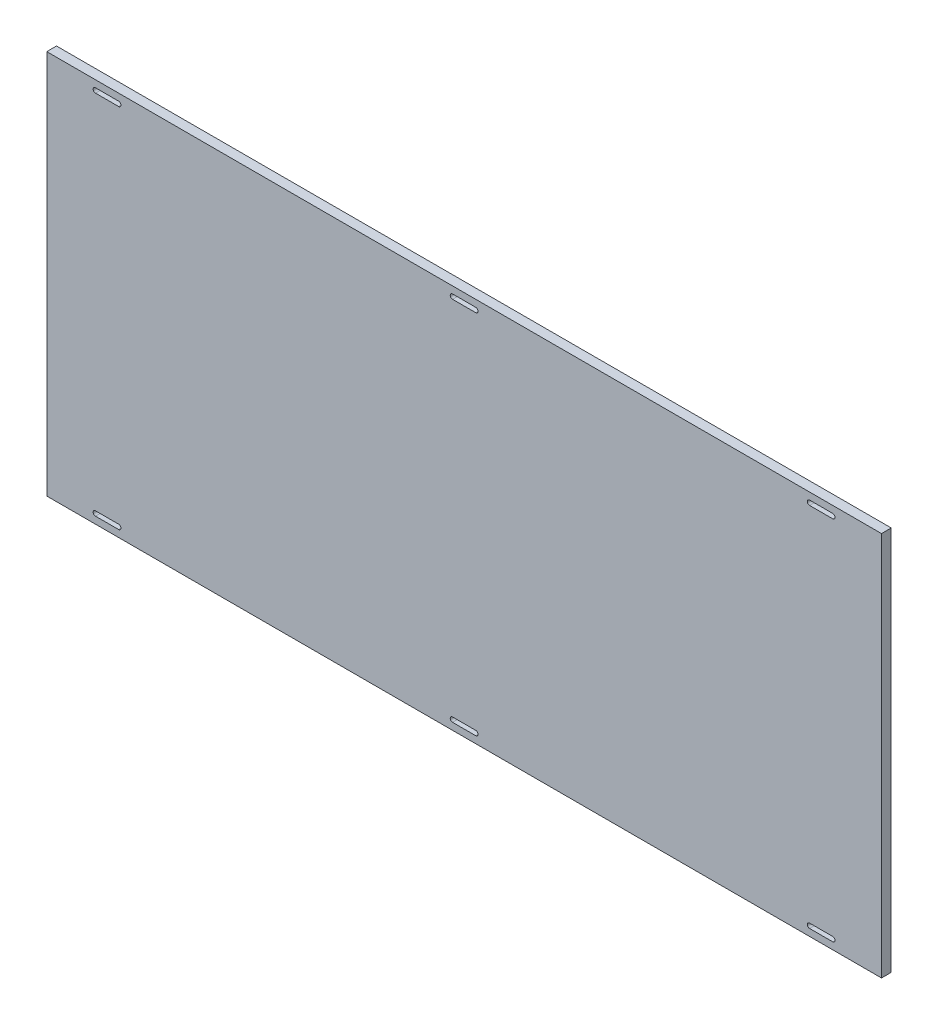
ISO-10303-21;
HEADER;
FILE_DESCRIPTION(('STEP AP214'),'2;1');
FILE_NAME('part.step','',(''),(''),'','','');
FILE_SCHEMA(('AUTOMOTIVE_DESIGN { 1 0 10303 214 1 1 1 1 }'));
ENDSEC;
DATA;
#1=APPLICATION_CONTEXT('core data for automotive mechanical design processes');
#2=APPLICATION_PROTOCOL_DEFINITION('international standard','automotive_design',2000,#1);
#3=PRODUCT_CONTEXT('',#1,'mechanical');
#4=PRODUCT('Part','Part','',(#3));
#5=PRODUCT_RELATED_PRODUCT_CATEGORY('part','',(#4));
#6=PRODUCT_DEFINITION_FORMATION('','',#4);
#7=PRODUCT_DEFINITION_CONTEXT('part definition',#1,'design');
#8=PRODUCT_DEFINITION('design','',#6,#7);
#9=PRODUCT_DEFINITION_SHAPE('','',#8);
#10=(LENGTH_UNIT() NAMED_UNIT(*) SI_UNIT(.MILLI.,.METRE.));
#11=(NAMED_UNIT(*) PLANE_ANGLE_UNIT() SI_UNIT($,.RADIAN.));
#12=(NAMED_UNIT(*) SI_UNIT($,.STERADIAN.) SOLID_ANGLE_UNIT());
#13=UNCERTAINTY_MEASURE_WITH_UNIT(LENGTH_MEASURE(1.E-05),#10,'distance_accuracy_value','');
#14=(GEOMETRIC_REPRESENTATION_CONTEXT(3) GLOBAL_UNCERTAINTY_ASSIGNED_CONTEXT((#13)) GLOBAL_UNIT_ASSIGNED_CONTEXT((#10,
#11,#12)) REPRESENTATION_CONTEXT('',''));
#15=CARTESIAN_POINT('',(0.,0.,0.));
#16=DIRECTION('',(0.,0.,1.));
#17=DIRECTION('',(1.,0.,0.));
#18=AXIS2_PLACEMENT_3D('',#15,#16,#17);
#19=CARTESIAN_POINT('',(-900.,-415.,0.));
#20=DIRECTION('',(0.,0.,1.));
#21=DIRECTION('',(1.,0.,0.));
#22=AXIS2_PLACEMENT_3D('',#19,#20,#21);
#23=PLANE('',#22);
#24=DIRECTION('',(1.,0.,0.));
#25=VECTOR('',#24,1.);
#26=CARTESIAN_POINT('',(-900.,415.,0.));
#27=LINE('',#26,#25);
#28=CARTESIAN_POINT('',(-900.,415.,0.));
#29=VERTEX_POINT('',#28);
#30=CARTESIAN_POINT('',(900.,415.,0.));
#31=VERTEX_POINT('',#30);
#32=EDGE_CURVE('E311',#29,#31,#27,.T.);
#33=ORIENTED_EDGE('',*,*,#32,.T.);
#34=DIRECTION('',(0.,1.,0.));
#35=VECTOR('',#34,1.);
#36=CARTESIAN_POINT('',(900.,415.,0.));
#37=LINE('',#36,#35);
#38=CARTESIAN_POINT('',(900.,-415.,0.));
#39=VERTEX_POINT('',#38);
#40=EDGE_CURVE('E374',#31,#39,#37,.F.);
#41=ORIENTED_EDGE('',*,*,#40,.T.);
#42=DIRECTION('',(1.,0.,0.));
#43=VECTOR('',#42,1.);
#44=CARTESIAN_POINT('',(-900.,-415.,0.));
#45=LINE('',#44,#43);
#46=CARTESIAN_POINT('',(-900.,-415.,0.));
#47=VERTEX_POINT('',#46);
#48=EDGE_CURVE('E369',#39,#47,#45,.F.);
#49=ORIENTED_EDGE('',*,*,#48,.T.);
#50=DIRECTION('',(0.,1.,0.));
#51=VECTOR('',#50,1.);
#52=CARTESIAN_POINT('',(-900.,415.,0.));
#53=LINE('',#52,#51);
#54=EDGE_CURVE('E365',#47,#29,#53,.T.);
#55=ORIENTED_EDGE('',*,*,#54,.T.);
#56=EDGE_LOOP('',(#33,#41,#49,#55));
#57=FACE_BOUND('',#56,.T.);
#58=CARTESIAN_POINT('',(-25.,-395.,0.));
#59=DIRECTION('',(0.,0.,1.));
#60=DIRECTION('',(1.,0.,0.));
#61=AXIS2_PLACEMENT_3D('',#58,#59,#60);
#62=CIRCLE('',#61,5.);
#63=CARTESIAN_POINT('',(-25.,-390.,0.));
#64=VERTEX_POINT('',#63);
#65=CARTESIAN_POINT('',(-25.,-400.,0.));
#66=VERTEX_POINT('',#65);
#67=EDGE_CURVE('E230',#64,#66,#62,.T.);
#68=ORIENTED_EDGE('',*,*,#67,.T.);
#69=DIRECTION('',(1.,0.,0.));
#70=VECTOR('',#69,1.);
#71=CARTESIAN_POINT('',(-25.,-400.,0.));
#72=LINE('',#71,#70);
#73=CARTESIAN_POINT('',(25.,-400.,0.));
#74=VERTEX_POINT('',#73);
#75=EDGE_CURVE('E223',#66,#74,#72,.T.);
#76=ORIENTED_EDGE('',*,*,#75,.T.);
#77=CARTESIAN_POINT('',(25.,-395.,0.));
#78=DIRECTION('',(0.,0.,1.));
#79=DIRECTION('',(1.,0.,0.));
#80=AXIS2_PLACEMENT_3D('',#77,#78,#79);
#81=CIRCLE('',#80,5.);
#82=CARTESIAN_POINT('',(25.,-390.,0.));
#83=VERTEX_POINT('',#82);
#84=EDGE_CURVE('E312',#74,#83,#81,.T.);
#85=ORIENTED_EDGE('',*,*,#84,.T.);
#86=DIRECTION('',(1.,0.,0.));
#87=VECTOR('',#86,1.);
#88=CARTESIAN_POINT('',(-25.,-390.,0.));
#89=LINE('',#88,#87);
#90=EDGE_CURVE('E227',#83,#64,#89,.F.);
#91=ORIENTED_EDGE('',*,*,#90,.T.);
#92=EDGE_LOOP('',(#68,#76,#85,#91));
#93=FACE_BOUND('',#92,.T.);
#94=CARTESIAN_POINT('',(-795.,-395.,0.));
#95=DIRECTION('',(0.,0.,1.));
#96=DIRECTION('',(1.,0.,0.));
#97=AXIS2_PLACEMENT_3D('',#94,#95,#96);
#98=CIRCLE('',#97,5.);
#99=CARTESIAN_POINT('',(-795.,-390.,0.));
#100=VERTEX_POINT('',#99);
#101=CARTESIAN_POINT('',(-795.,-400.,0.));
#102=VERTEX_POINT('',#101);
#103=EDGE_CURVE('E238',#100,#102,#98,.T.);
#104=ORIENTED_EDGE('',*,*,#103,.T.);
#105=DIRECTION('',(1.,0.,0.));
#106=VECTOR('',#105,1.);
#107=CARTESIAN_POINT('',(-795.,-400.,0.));
#108=LINE('',#107,#106);
#109=CARTESIAN_POINT('',(-745.,-400.,0.));
#110=VERTEX_POINT('',#109);
#111=EDGE_CURVE('E231',#102,#110,#108,.T.);
#112=ORIENTED_EDGE('',*,*,#111,.T.);
#113=CARTESIAN_POINT('',(-745.,-395.,0.));
#114=DIRECTION('',(0.,0.,1.));
#115=DIRECTION('',(1.,0.,0.));
#116=AXIS2_PLACEMENT_3D('',#113,#114,#115);
#117=CIRCLE('',#116,5.);
#118=CARTESIAN_POINT('',(-745.,-390.,0.));
#119=VERTEX_POINT('',#118);
#120=EDGE_CURVE('E316',#110,#119,#117,.T.);
#121=ORIENTED_EDGE('',*,*,#120,.T.);
#122=DIRECTION('',(1.,0.,0.));
#123=VECTOR('',#122,1.);
#124=CARTESIAN_POINT('',(-795.,-390.,0.));
#125=LINE('',#124,#123);
#126=EDGE_CURVE('E235',#119,#100,#125,.F.);
#127=ORIENTED_EDGE('',*,*,#126,.T.);
#128=EDGE_LOOP('',(#104,#112,#121,#127));
#129=FACE_BOUND('',#128,.T.);
#130=DIRECTION('',(1.,0.,0.));
#131=VECTOR('',#130,1.);
#132=CARTESIAN_POINT('',(795.,-400.,0.));
#133=LINE('',#132,#131);
#134=CARTESIAN_POINT('',(745.,-400.,0.));
#135=VERTEX_POINT('',#134);
#136=CARTESIAN_POINT('',(795.,-400.,0.));
#137=VERTEX_POINT('',#136);
#138=EDGE_CURVE('E243',#135,#137,#133,.T.);
#139=ORIENTED_EDGE('',*,*,#138,.T.);
#140=CARTESIAN_POINT('',(795.,-395.,0.));
#141=DIRECTION('',(0.,0.,1.));
#142=DIRECTION('',(1.,0.,0.));
#143=AXIS2_PLACEMENT_3D('',#140,#141,#142);
#144=CIRCLE('',#143,5.);
#145=CARTESIAN_POINT('',(795.,-390.,0.));
#146=VERTEX_POINT('',#145);
#147=EDGE_CURVE('E320',#137,#146,#144,.T.);
#148=ORIENTED_EDGE('',*,*,#147,.T.);
#149=DIRECTION('',(-1.,0.,0.));
#150=VECTOR('',#149,1.);
#151=CARTESIAN_POINT('',(795.,-390.,0.));
#152=LINE('',#151,#150);
#153=CARTESIAN_POINT('',(745.,-390.,0.));
#154=VERTEX_POINT('',#153);
#155=EDGE_CURVE('E239',#146,#154,#152,.T.);
#156=ORIENTED_EDGE('',*,*,#155,.T.);
#157=CARTESIAN_POINT('',(745.,-395.,0.));
#158=DIRECTION('',(0.,0.,1.));
#159=DIRECTION('',(1.,0.,0.));
#160=AXIS2_PLACEMENT_3D('',#157,#158,#159);
#161=CIRCLE('',#160,5.);
#162=EDGE_CURVE('E324',#154,#135,#161,.T.);
#163=ORIENTED_EDGE('',*,*,#162,.T.);
#164=EDGE_LOOP('',(#139,#148,#156,#163));
#165=FACE_BOUND('',#164,.T.);
#166=DIRECTION('',(1.,0.,0.));
#167=VECTOR('',#166,1.);
#168=CARTESIAN_POINT('',(795.,390.,0.));
#169=LINE('',#168,#167);
#170=CARTESIAN_POINT('',(745.,390.,0.));
#171=VERTEX_POINT('',#170);
#172=CARTESIAN_POINT('',(795.,390.,0.));
#173=VERTEX_POINT('',#172);
#174=EDGE_CURVE('E252',#171,#173,#169,.T.);
#175=ORIENTED_EDGE('',*,*,#174,.T.);
#176=CARTESIAN_POINT('',(795.,395.,0.));
#177=DIRECTION('',(0.,0.,1.));
#178=DIRECTION('',(1.,0.,0.));
#179=AXIS2_PLACEMENT_3D('',#176,#177,#178);
#180=CIRCLE('',#179,5.);
#181=CARTESIAN_POINT('',(795.,400.,0.));
#182=VERTEX_POINT('',#181);
#183=EDGE_CURVE('E247',#173,#182,#180,.T.);
#184=ORIENTED_EDGE('',*,*,#183,.T.);
#185=DIRECTION('',(-1.,0.,0.));
#186=VECTOR('',#185,1.);
#187=CARTESIAN_POINT('',(795.,400.,0.));
#188=LINE('',#187,#186);
#189=CARTESIAN_POINT('',(745.,400.,0.));
#190=VERTEX_POINT('',#189);
#191=EDGE_CURVE('E248',#182,#190,#188,.T.);
#192=ORIENTED_EDGE('',*,*,#191,.T.);
#193=CARTESIAN_POINT('',(745.,395.,0.));
#194=DIRECTION('',(0.,0.,1.));
#195=DIRECTION('',(1.,0.,0.));
#196=AXIS2_PLACEMENT_3D('',#193,#194,#195);
#197=CIRCLE('',#196,5.);
#198=EDGE_CURVE('E329',#190,#171,#197,.T.);
#199=ORIENTED_EDGE('',*,*,#198,.T.);
#200=EDGE_LOOP('',(#175,#184,#192,#199));
#201=FACE_BOUND('',#200,.T.);
#202=DIRECTION('',(1.,0.,0.));
#203=VECTOR('',#202,1.);
#204=CARTESIAN_POINT('',(-25.0000000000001,390.,0.));
#205=LINE('',#204,#203);
#206=CARTESIAN_POINT('',(-25.0000000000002,390.,0.));
#207=VERTEX_POINT('',#206);
#208=CARTESIAN_POINT('',(25.,390.,0.));
#209=VERTEX_POINT('',#208);
#210=EDGE_CURVE('E261',#207,#209,#205,.T.);
#211=ORIENTED_EDGE('',*,*,#210,.T.);
#212=CARTESIAN_POINT('',(25.,395.,0.));
#213=DIRECTION('',(0.,0.,1.));
#214=DIRECTION('',(1.,0.,0.));
#215=AXIS2_PLACEMENT_3D('',#212,#213,#214);
#216=CIRCLE('',#215,5.);
#217=CARTESIAN_POINT('',(25.,400.,0.));
#218=VERTEX_POINT('',#217);
#219=EDGE_CURVE('E256',#209,#218,#216,.T.);
#220=ORIENTED_EDGE('',*,*,#219,.T.);
#221=DIRECTION('',(1.,0.,0.));
#222=VECTOR('',#221,1.);
#223=CARTESIAN_POINT('',(-25.0000000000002,400.,0.));
#224=LINE('',#223,#222);
#225=CARTESIAN_POINT('',(-25.0000000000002,400.,0.));
#226=VERTEX_POINT('',#225);
#227=EDGE_CURVE('E257',#218,#226,#224,.F.);
#228=ORIENTED_EDGE('',*,*,#227,.T.);
#229=CARTESIAN_POINT('',(-25.0000000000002,395.,0.));
#230=DIRECTION('',(0.,0.,1.));
#231=DIRECTION('',(1.,0.,0.));
#232=AXIS2_PLACEMENT_3D('',#229,#230,#231);
#233=CIRCLE('',#232,5.);
#234=EDGE_CURVE('E334',#226,#207,#233,.T.);
#235=ORIENTED_EDGE('',*,*,#234,.T.);
#236=EDGE_LOOP('',(#211,#220,#228,#235));
#237=FACE_BOUND('',#236,.T.);
#238=CARTESIAN_POINT('',(-795.,395.,0.));
#239=DIRECTION('',(0.,0.,1.));
#240=DIRECTION('',(1.,0.,0.));
#241=AXIS2_PLACEMENT_3D('',#238,#239,#240);
#242=CIRCLE('',#241,5.);
#243=CARTESIAN_POINT('',(-795.,400.,0.));
#244=VERTEX_POINT('',#243);
#245=CARTESIAN_POINT('',(-795.,390.,0.));
#246=VERTEX_POINT('',#245);
#247=EDGE_CURVE('E19',#244,#246,#242,.T.);
#248=ORIENTED_EDGE('',*,*,#247,.T.);
#249=DIRECTION('',(1.,0.,0.));
#250=VECTOR('',#249,1.);
#251=CARTESIAN_POINT('',(-795.,390.,0.));
#252=LINE('',#251,#250);
#253=CARTESIAN_POINT('',(-745.,390.,0.));
#254=VERTEX_POINT('',#253);
#255=EDGE_CURVE('E266',#246,#254,#252,.T.);
#256=ORIENTED_EDGE('',*,*,#255,.T.);
#257=CARTESIAN_POINT('',(-745.,395.,0.));
#258=DIRECTION('',(0.,0.,1.));
#259=DIRECTION('',(1.,0.,0.));
#260=AXIS2_PLACEMENT_3D('',#257,#258,#259);
#261=CIRCLE('',#260,5.);
#262=CARTESIAN_POINT('',(-745.,400.,0.));
#263=VERTEX_POINT('',#262);
#264=EDGE_CURVE('E202',#254,#263,#261,.T.);
#265=ORIENTED_EDGE('',*,*,#264,.T.);
#266=DIRECTION('',(1.,0.,0.));
#267=VECTOR('',#266,1.);
#268=CARTESIAN_POINT('',(-795.,400.,0.));
#269=LINE('',#268,#267);
#270=EDGE_CURVE('E198',#263,#244,#269,.F.);
#271=ORIENTED_EDGE('',*,*,#270,.T.);
#272=EDGE_LOOP('',(#248,#256,#265,#271));
#273=FACE_BOUND('',#272,.T.);
#274=ADVANCED_FACE('F16',(#57,#93,#129,#165,#201,#237,#273),#23,.F.);
#275=CARTESIAN_POINT('',(-795.,395.,0.));
#276=DIRECTION('',(0.,0.,1.));
#277=DIRECTION('',(1.,0.,0.));
#278=AXIS2_PLACEMENT_3D('',#275,#276,#277);
#279=CYLINDRICAL_SURFACE('',#278,5.);
#280=DIRECTION('',(0.,0.,-1.));
#281=VECTOR('',#280,1.);
#282=CARTESIAN_POINT('',(-795.,390.,0.));
#283=LINE('',#282,#281);
#284=CARTESIAN_POINT('',(-795.,390.,21.));
#285=VERTEX_POINT('',#284);
#286=EDGE_CURVE('E212',#285,#246,#283,.T.);
#287=ORIENTED_EDGE('',*,*,#286,.T.);
#288=ORIENTED_EDGE('',*,*,#247,.F.);
#289=DIRECTION('',(0.,0.,1.));
#290=VECTOR('',#289,1.);
#291=CARTESIAN_POINT('',(-795.,400.,0.));
#292=LINE('',#291,#290);
#293=CARTESIAN_POINT('',(-795.,400.,21.));
#294=VERTEX_POINT('',#293);
#295=EDGE_CURVE('E206',#244,#294,#292,.T.);
#296=ORIENTED_EDGE('',*,*,#295,.T.);
#297=CARTESIAN_POINT('',(-795.,395.,21.));
#298=DIRECTION('',(0.,0.,1.));
#299=DIRECTION('',(1.,0.,0.));
#300=AXIS2_PLACEMENT_3D('',#297,#298,#299);
#301=CIRCLE('',#300,5.);
#302=EDGE_CURVE('E309',#285,#294,#301,.F.);
#303=ORIENTED_EDGE('',*,*,#302,.F.);
#304=EDGE_LOOP('',(#287,#288,#296,#303));
#305=FACE_BOUND('',#304,.T.);
#306=ADVANCED_FACE('F209',(#305),#279,.F.);
#307=CARTESIAN_POINT('',(-795.,400.,0.));
#308=DIRECTION('',(0.,1.,0.));
#309=DIRECTION('',(0.,0.,1.));
#310=AXIS2_PLACEMENT_3D('',#307,#308,#309);
#311=PLANE('',#310);
#312=ORIENTED_EDGE('',*,*,#295,.F.);
#313=ORIENTED_EDGE('',*,*,#270,.F.);
#314=DIRECTION('',(0.,0.,1.));
#315=VECTOR('',#314,1.);
#316=CARTESIAN_POINT('',(-745.,400.,0.));
#317=LINE('',#316,#315);
#318=CARTESIAN_POINT('',(-745.,400.,21.));
#319=VERTEX_POINT('',#318);
#320=EDGE_CURVE('E218',#263,#319,#317,.T.);
#321=ORIENTED_EDGE('',*,*,#320,.T.);
#322=DIRECTION('',(1.,0.,0.));
#323=VECTOR('',#322,1.);
#324=CARTESIAN_POINT('',(-900.,400.,21.));
#325=LINE('',#324,#323);
#326=EDGE_CURVE('E216',#294,#319,#325,.T.);
#327=ORIENTED_EDGE('',*,*,#326,.F.);
#328=EDGE_LOOP('',(#312,#313,#321,#327));
#329=FACE_BOUND('',#328,.T.);
#330=ADVANCED_FACE('F214',(#329),#311,.F.);
#331=CARTESIAN_POINT('',(-745.,395.,0.));
#332=DIRECTION('',(0.,0.,1.));
#333=DIRECTION('',(1.,0.,0.));
#334=AXIS2_PLACEMENT_3D('',#331,#332,#333);
#335=CYLINDRICAL_SURFACE('',#334,5.);
#336=ORIENTED_EDGE('',*,*,#264,.F.);
#337=DIRECTION('',(0.,0.,-1.));
#338=VECTOR('',#337,1.);
#339=CARTESIAN_POINT('',(-745.,390.,0.));
#340=LINE('',#339,#338);
#341=CARTESIAN_POINT('',(-745.,390.,21.));
#342=VERTEX_POINT('',#341);
#343=EDGE_CURVE('E265',#254,#342,#340,.F.);
#344=ORIENTED_EDGE('',*,*,#343,.T.);
#345=CARTESIAN_POINT('',(-745.,395.,21.));
#346=DIRECTION('',(0.,0.,1.));
#347=DIRECTION('',(1.,0.,0.));
#348=AXIS2_PLACEMENT_3D('',#345,#346,#347);
#349=CIRCLE('',#348,5.);
#350=EDGE_CURVE('E307',#319,#342,#349,.F.);
#351=ORIENTED_EDGE('',*,*,#350,.F.);
#352=ORIENTED_EDGE('',*,*,#320,.F.);
#353=EDGE_LOOP('',(#336,#344,#351,#352));
#354=FACE_BOUND('',#353,.T.);
#355=ADVANCED_FACE('F665',(#354),#335,.F.);
#356=CARTESIAN_POINT('',(-795.,390.,0.));
#357=DIRECTION('',(0.,-1.,0.));
#358=DIRECTION('',(0.,0.,-1.));
#359=AXIS2_PLACEMENT_3D('',#356,#357,#358);
#360=PLANE('',#359);
#361=ORIENTED_EDGE('',*,*,#343,.F.);
#362=ORIENTED_EDGE('',*,*,#255,.F.);
#363=ORIENTED_EDGE('',*,*,#286,.F.);
#364=DIRECTION('',(1.,0.,0.));
#365=VECTOR('',#364,1.);
#366=CARTESIAN_POINT('',(-900.,390.,21.));
#367=LINE('',#366,#365);
#368=EDGE_CURVE('E306',#342,#285,#367,.F.);
#369=ORIENTED_EDGE('',*,*,#368,.F.);
#370=EDGE_LOOP('',(#361,#362,#363,#369));
#371=FACE_BOUND('',#370,.T.);
#372=ADVANCED_FACE('F656',(#371),#360,.F.);
#373=CARTESIAN_POINT('',(-25.0000000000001,390.,0.));
#374=DIRECTION('',(0.,-1.,0.));
#375=DIRECTION('',(0.,0.,-1.));
#376=AXIS2_PLACEMENT_3D('',#373,#374,#375);
#377=PLANE('',#376);
#378=DIRECTION('',(0.,0.,-1.));
#379=VECTOR('',#378,1.);
#380=CARTESIAN_POINT('',(24.9999999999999,390.,0.));
#381=LINE('',#380,#379);
#382=CARTESIAN_POINT('',(25.,390.,21.));
#383=VERTEX_POINT('',#382);
#384=EDGE_CURVE('E264',#209,#383,#381,.F.);
#385=ORIENTED_EDGE('',*,*,#384,.F.);
#386=ORIENTED_EDGE('',*,*,#210,.F.);
#387=DIRECTION('',(0.,0.,1.));
#388=VECTOR('',#387,1.);
#389=CARTESIAN_POINT('',(-25.0000000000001,390.,0.));
#390=LINE('',#389,#388);
#391=CARTESIAN_POINT('',(-25.0000000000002,390.,21.));
#392=VERTEX_POINT('',#391);
#393=EDGE_CURVE('E260',#207,#392,#390,.T.);
#394=ORIENTED_EDGE('',*,*,#393,.T.);
#395=DIRECTION('',(1.,0.,0.));
#396=VECTOR('',#395,1.);
#397=CARTESIAN_POINT('',(-900.,390.,21.));
#398=LINE('',#397,#396);
#399=EDGE_CURVE('E302',#383,#392,#398,.F.);
#400=ORIENTED_EDGE('',*,*,#399,.F.);
#401=EDGE_LOOP('',(#385,#386,#394,#400));
#402=FACE_BOUND('',#401,.T.);
#403=ADVANCED_FACE('F647',(#402),#377,.F.);
#404=CARTESIAN_POINT('',(-25.0000000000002,395.,0.));
#405=DIRECTION('',(0.,0.,1.));
#406=DIRECTION('',(1.,0.,0.));
#407=AXIS2_PLACEMENT_3D('',#404,#405,#406);
#408=CYLINDRICAL_SURFACE('',#407,5.);
#409=ORIENTED_EDGE('',*,*,#393,.F.);
#410=ORIENTED_EDGE('',*,*,#234,.F.);
#411=DIRECTION('',(0.,0.,1.));
#412=VECTOR('',#411,1.);
#413=CARTESIAN_POINT('',(-25.0000000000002,400.,0.));
#414=LINE('',#413,#412);
#415=CARTESIAN_POINT('',(-25.0000000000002,400.,21.));
#416=VERTEX_POINT('',#415);
#417=EDGE_CURVE('E259',#226,#416,#414,.T.);
#418=ORIENTED_EDGE('',*,*,#417,.T.);
#419=CARTESIAN_POINT('',(-25.0000000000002,395.,21.));
#420=DIRECTION('',(0.,0.,1.));
#421=DIRECTION('',(1.,0.,0.));
#422=AXIS2_PLACEMENT_3D('',#419,#420,#421);
#423=CIRCLE('',#422,5.);
#424=EDGE_CURVE('E299',#392,#416,#423,.F.);
#425=ORIENTED_EDGE('',*,*,#424,.F.);
#426=EDGE_LOOP('',(#409,#410,#418,#425));
#427=FACE_BOUND('',#426,.T.);
#428=ADVANCED_FACE('F638',(#427),#408,.F.);
#429=CARTESIAN_POINT('',(-25.0000000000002,400.,0.));
#430=DIRECTION('',(0.,1.,0.));
#431=DIRECTION('',(0.,0.,1.));
#432=AXIS2_PLACEMENT_3D('',#429,#430,#431);
#433=PLANE('',#432);
#434=ORIENTED_EDGE('',*,*,#417,.F.);
#435=ORIENTED_EDGE('',*,*,#227,.F.);
#436=DIRECTION('',(0.,0.,1.));
#437=VECTOR('',#436,1.);
#438=CARTESIAN_POINT('',(25.,400.,0.));
#439=LINE('',#438,#437);
#440=CARTESIAN_POINT('',(25.,400.,21.));
#441=VERTEX_POINT('',#440);
#442=EDGE_CURVE('E333',#218,#441,#439,.T.);
#443=ORIENTED_EDGE('',*,*,#442,.T.);
#444=DIRECTION('',(1.,0.,0.));
#445=VECTOR('',#444,1.);
#446=CARTESIAN_POINT('',(-900.,400.,21.));
#447=LINE('',#446,#445);
#448=EDGE_CURVE('E298',#416,#441,#447,.T.);
#449=ORIENTED_EDGE('',*,*,#448,.F.);
#450=EDGE_LOOP('',(#434,#435,#443,#449));
#451=FACE_BOUND('',#450,.T.);
#452=ADVANCED_FACE('F629',(#451),#433,.F.);
#453=CARTESIAN_POINT('',(25.,395.,0.));
#454=DIRECTION('',(0.,0.,1.));
#455=DIRECTION('',(1.,0.,0.));
#456=AXIS2_PLACEMENT_3D('',#453,#454,#455);
#457=CYLINDRICAL_SURFACE('',#456,5.);
#458=ORIENTED_EDGE('',*,*,#219,.F.);
#459=ORIENTED_EDGE('',*,*,#384,.T.);
#460=CARTESIAN_POINT('',(25.,395.,21.));
#461=DIRECTION('',(0.,0.,1.));
#462=DIRECTION('',(1.,0.,0.));
#463=AXIS2_PLACEMENT_3D('',#460,#461,#462);
#464=CIRCLE('',#463,5.);
#465=EDGE_CURVE('E303',#441,#383,#464,.F.);
#466=ORIENTED_EDGE('',*,*,#465,.F.);
#467=ORIENTED_EDGE('',*,*,#442,.F.);
#468=EDGE_LOOP('',(#458,#459,#466,#467));
#469=FACE_BOUND('',#468,.T.);
#470=ADVANCED_FACE('F620',(#469),#457,.F.);
#471=CARTESIAN_POINT('',(795.,390.,0.));
#472=DIRECTION('',(0.,-1.,0.));
#473=DIRECTION('',(1.,0.,0.));
#474=AXIS2_PLACEMENT_3D('',#471,#472,#473);
#475=PLANE('',#474);
#476=DIRECTION('',(0.,0.,1.));
#477=VECTOR('',#476,1.);
#478=CARTESIAN_POINT('',(795.,390.,0.));
#479=LINE('',#478,#477);
#480=CARTESIAN_POINT('',(795.,390.,21.));
#481=VERTEX_POINT('',#480);
#482=EDGE_CURVE('E255',#173,#481,#479,.T.);
#483=ORIENTED_EDGE('',*,*,#482,.F.);
#484=ORIENTED_EDGE('',*,*,#174,.F.);
#485=DIRECTION('',(0.,0.,1.));
#486=VECTOR('',#485,1.);
#487=CARTESIAN_POINT('',(745.,390.,0.));
#488=LINE('',#487,#486);
#489=CARTESIAN_POINT('',(745.,390.,21.));
#490=VERTEX_POINT('',#489);
#491=EDGE_CURVE('E251',#171,#490,#488,.T.);
#492=ORIENTED_EDGE('',*,*,#491,.T.);
#493=DIRECTION('',(1.,0.,0.));
#494=VECTOR('',#493,1.);
#495=CARTESIAN_POINT('',(-900.,390.,21.));
#496=LINE('',#495,#494);
#497=EDGE_CURVE('E294',#481,#490,#496,.F.);
#498=ORIENTED_EDGE('',*,*,#497,.F.);
#499=EDGE_LOOP('',(#483,#484,#492,#498));
#500=FACE_BOUND('',#499,.T.);
#501=ADVANCED_FACE('F611',(#500),#475,.F.);
#502=CARTESIAN_POINT('',(745.,395.,0.));
#503=DIRECTION('',(0.,0.,1.));
#504=DIRECTION('',(1.,0.,0.));
#505=AXIS2_PLACEMENT_3D('',#502,#503,#504);
#506=CYLINDRICAL_SURFACE('',#505,5.);
#507=ORIENTED_EDGE('',*,*,#491,.F.);
#508=ORIENTED_EDGE('',*,*,#198,.F.);
#509=DIRECTION('',(0.,0.,1.));
#510=VECTOR('',#509,1.);
#511=CARTESIAN_POINT('',(745.,400.,0.));
#512=LINE('',#511,#510);
#513=CARTESIAN_POINT('',(745.,400.,21.));
#514=VERTEX_POINT('',#513);
#515=EDGE_CURVE('E250',#190,#514,#512,.T.);
#516=ORIENTED_EDGE('',*,*,#515,.T.);
#517=CARTESIAN_POINT('',(745.,395.,21.));
#518=DIRECTION('',(0.,0.,1.));
#519=DIRECTION('',(1.,0.,0.));
#520=AXIS2_PLACEMENT_3D('',#517,#518,#519);
#521=CIRCLE('',#520,5.);
#522=EDGE_CURVE('E291',#490,#514,#521,.F.);
#523=ORIENTED_EDGE('',*,*,#522,.F.);
#524=EDGE_LOOP('',(#507,#508,#516,#523));
#525=FACE_BOUND('',#524,.T.);
#526=ADVANCED_FACE('F602',(#525),#506,.F.);
#527=CARTESIAN_POINT('',(795.,400.,0.));
#528=DIRECTION('',(0.,1.,0.));
#529=DIRECTION('',(-1.,0.,0.));
#530=AXIS2_PLACEMENT_3D('',#527,#528,#529);
#531=PLANE('',#530);
#532=ORIENTED_EDGE('',*,*,#515,.F.);
#533=ORIENTED_EDGE('',*,*,#191,.F.);
#534=DIRECTION('',(0.,0.,1.));
#535=VECTOR('',#534,1.);
#536=CARTESIAN_POINT('',(795.,400.,0.));
#537=LINE('',#536,#535);
#538=CARTESIAN_POINT('',(795.,400.,21.));
#539=VERTEX_POINT('',#538);
#540=EDGE_CURVE('E328',#182,#539,#537,.T.);
#541=ORIENTED_EDGE('',*,*,#540,.T.);
#542=DIRECTION('',(1.,0.,0.));
#543=VECTOR('',#542,1.);
#544=CARTESIAN_POINT('',(-900.,400.,21.));
#545=LINE('',#544,#543);
#546=EDGE_CURVE('E290',#514,#539,#545,.T.);
#547=ORIENTED_EDGE('',*,*,#546,.F.);
#548=EDGE_LOOP('',(#532,#533,#541,#547));
#549=FACE_BOUND('',#548,.T.);
#550=ADVANCED_FACE('F593',(#549),#531,.F.);
#551=CARTESIAN_POINT('',(795.,395.,0.));
#552=DIRECTION('',(0.,0.,1.));
#553=DIRECTION('',(1.,0.,0.));
#554=AXIS2_PLACEMENT_3D('',#551,#552,#553);
#555=CYLINDRICAL_SURFACE('',#554,5.);
#556=ORIENTED_EDGE('',*,*,#183,.F.);
#557=ORIENTED_EDGE('',*,*,#482,.T.);
#558=CARTESIAN_POINT('',(795.,395.,21.));
#559=DIRECTION('',(0.,0.,1.));
#560=DIRECTION('',(1.,0.,0.));
#561=AXIS2_PLACEMENT_3D('',#558,#559,#560);
#562=CIRCLE('',#561,5.);
#563=EDGE_CURVE('E295',#539,#481,#562,.F.);
#564=ORIENTED_EDGE('',*,*,#563,.F.);
#565=ORIENTED_EDGE('',*,*,#540,.F.);
#566=EDGE_LOOP('',(#556,#557,#564,#565));
#567=FACE_BOUND('',#566,.T.);
#568=ADVANCED_FACE('F584',(#567),#555,.F.);
#569=CARTESIAN_POINT('',(795.,-400.,0.));
#570=DIRECTION('',(0.,-1.,0.));
#571=DIRECTION('',(1.,0.,0.));
#572=AXIS2_PLACEMENT_3D('',#569,#570,#571);
#573=PLANE('',#572);
#574=DIRECTION('',(0.,0.,1.));
#575=VECTOR('',#574,1.);
#576=CARTESIAN_POINT('',(795.,-400.,0.));
#577=LINE('',#576,#575);
#578=CARTESIAN_POINT('',(795.,-400.,21.));
#579=VERTEX_POINT('',#578);
#580=EDGE_CURVE('E246',#137,#579,#577,.T.);
#581=ORIENTED_EDGE('',*,*,#580,.F.);
#582=ORIENTED_EDGE('',*,*,#138,.F.);
#583=DIRECTION('',(0.,0.,1.));
#584=VECTOR('',#583,1.);
#585=CARTESIAN_POINT('',(745.,-400.,0.));
#586=LINE('',#585,#584);
#587=CARTESIAN_POINT('',(745.,-400.,21.));
#588=VERTEX_POINT('',#587);
#589=EDGE_CURVE('E242',#135,#588,#586,.T.);
#590=ORIENTED_EDGE('',*,*,#589,.T.);
#591=DIRECTION('',(1.,0.,0.));
#592=VECTOR('',#591,1.);
#593=CARTESIAN_POINT('',(-900.,-400.,21.));
#594=LINE('',#593,#592);
#595=EDGE_CURVE('E286',#579,#588,#594,.F.);
#596=ORIENTED_EDGE('',*,*,#595,.F.);
#597=EDGE_LOOP('',(#581,#582,#590,#596));
#598=FACE_BOUND('',#597,.T.);
#599=ADVANCED_FACE('F575',(#598),#573,.F.);
#600=CARTESIAN_POINT('',(745.,-395.,0.));
#601=DIRECTION('',(0.,0.,1.));
#602=DIRECTION('',(1.,0.,0.));
#603=AXIS2_PLACEMENT_3D('',#600,#601,#602);
#604=CYLINDRICAL_SURFACE('',#603,5.);
#605=ORIENTED_EDGE('',*,*,#589,.F.);
#606=ORIENTED_EDGE('',*,*,#162,.F.);
#607=DIRECTION('',(0.,0.,1.));
#608=VECTOR('',#607,1.);
#609=CARTESIAN_POINT('',(745.,-390.,0.));
#610=LINE('',#609,#608);
#611=CARTESIAN_POINT('',(745.,-390.,21.));
#612=VERTEX_POINT('',#611);
#613=EDGE_CURVE('E241',#154,#612,#610,.T.);
#614=ORIENTED_EDGE('',*,*,#613,.T.);
#615=CARTESIAN_POINT('',(745.,-395.,21.));
#616=DIRECTION('',(0.,0.,1.));
#617=DIRECTION('',(1.,0.,0.));
#618=AXIS2_PLACEMENT_3D('',#615,#616,#617);
#619=CIRCLE('',#618,5.);
#620=EDGE_CURVE('E283',#588,#612,#619,.F.);
#621=ORIENTED_EDGE('',*,*,#620,.F.);
#622=EDGE_LOOP('',(#605,#606,#614,#621));
#623=FACE_BOUND('',#622,.T.);
#624=ADVANCED_FACE('F566',(#623),#604,.F.);
#625=CARTESIAN_POINT('',(795.,-390.,0.));
#626=DIRECTION('',(0.,1.,0.));
#627=DIRECTION('',(-1.,0.,0.));
#628=AXIS2_PLACEMENT_3D('',#625,#626,#627);
#629=PLANE('',#628);
#630=ORIENTED_EDGE('',*,*,#613,.F.);
#631=ORIENTED_EDGE('',*,*,#155,.F.);
#632=DIRECTION('',(0.,0.,1.));
#633=VECTOR('',#632,1.);
#634=CARTESIAN_POINT('',(795.,-390.,0.));
#635=LINE('',#634,#633);
#636=CARTESIAN_POINT('',(795.,-390.,21.));
#637=VERTEX_POINT('',#636);
#638=EDGE_CURVE('E323',#146,#637,#635,.T.);
#639=ORIENTED_EDGE('',*,*,#638,.T.);
#640=DIRECTION('',(1.,0.,0.));
#641=VECTOR('',#640,1.);
#642=CARTESIAN_POINT('',(-900.,-390.,21.));
#643=LINE('',#642,#641);
#644=EDGE_CURVE('E282',#612,#637,#643,.T.);
#645=ORIENTED_EDGE('',*,*,#644,.F.);
#646=EDGE_LOOP('',(#630,#631,#639,#645));
#647=FACE_BOUND('',#646,.T.);
#648=ADVANCED_FACE('F557',(#647),#629,.F.);
#649=CARTESIAN_POINT('',(795.,-395.,0.));
#650=DIRECTION('',(0.,0.,1.));
#651=DIRECTION('',(1.,0.,0.));
#652=AXIS2_PLACEMENT_3D('',#649,#650,#651);
#653=CYLINDRICAL_SURFACE('',#652,5.);
#654=ORIENTED_EDGE('',*,*,#147,.F.);
#655=ORIENTED_EDGE('',*,*,#580,.T.);
#656=CARTESIAN_POINT('',(795.,-395.,21.));
#657=DIRECTION('',(0.,0.,1.));
#658=DIRECTION('',(1.,0.,0.));
#659=AXIS2_PLACEMENT_3D('',#656,#657,#658);
#660=CIRCLE('',#659,5.);
#661=EDGE_CURVE('E287',#637,#579,#660,.F.);
#662=ORIENTED_EDGE('',*,*,#661,.F.);
#663=ORIENTED_EDGE('',*,*,#638,.F.);
#664=EDGE_LOOP('',(#654,#655,#662,#663));
#665=FACE_BOUND('',#664,.T.);
#666=ADVANCED_FACE('F548',(#665),#653,.F.);
#667=CARTESIAN_POINT('',(-795.,-395.,0.));
#668=DIRECTION('',(0.,0.,1.));
#669=DIRECTION('',(1.,0.,0.));
#670=AXIS2_PLACEMENT_3D('',#667,#668,#669);
#671=CYLINDRICAL_SURFACE('',#670,5.);
#672=DIRECTION('',(0.,0.,-1.));
#673=VECTOR('',#672,1.);
#674=CARTESIAN_POINT('',(-795.,-400.,0.));
#675=LINE('',#674,#673);
#676=CARTESIAN_POINT('',(-795.,-400.,21.));
#677=VERTEX_POINT('',#676);
#678=EDGE_CURVE('E234',#677,#102,#675,.T.);
#679=ORIENTED_EDGE('',*,*,#678,.T.);
#680=ORIENTED_EDGE('',*,*,#103,.F.);
#681=DIRECTION('',(0.,0.,1.));
#682=VECTOR('',#681,1.);
#683=CARTESIAN_POINT('',(-795.,-390.,0.));
#684=LINE('',#683,#682);
#685=CARTESIAN_POINT('',(-795.,-390.,21.));
#686=VERTEX_POINT('',#685);
#687=EDGE_CURVE('E237',#100,#686,#684,.T.);
#688=ORIENTED_EDGE('',*,*,#687,.T.);
#689=CARTESIAN_POINT('',(-795.,-395.,21.));
#690=DIRECTION('',(0.,0.,1.));
#691=DIRECTION('',(1.,0.,0.));
#692=AXIS2_PLACEMENT_3D('',#689,#690,#691);
#693=CIRCLE('',#692,5.);
#694=EDGE_CURVE('E279',#677,#686,#693,.F.);
#695=ORIENTED_EDGE('',*,*,#694,.F.);
#696=EDGE_LOOP('',(#679,#680,#688,#695));
#697=FACE_BOUND('',#696,.T.);
#698=ADVANCED_FACE('F539',(#697),#671,.F.);
#699=CARTESIAN_POINT('',(-795.,-390.,0.));
#700=DIRECTION('',(0.,1.,0.));
#701=DIRECTION('',(0.,0.,1.));
#702=AXIS2_PLACEMENT_3D('',#699,#700,#701);
#703=PLANE('',#702);
#704=ORIENTED_EDGE('',*,*,#687,.F.);
#705=ORIENTED_EDGE('',*,*,#126,.F.);
#706=DIRECTION('',(0.,0.,1.));
#707=VECTOR('',#706,1.);
#708=CARTESIAN_POINT('',(-745.,-390.,0.));
#709=LINE('',#708,#707);
#710=CARTESIAN_POINT('',(-745.,-390.,21.));
#711=VERTEX_POINT('',#710);
#712=EDGE_CURVE('E318',#119,#711,#709,.T.);
#713=ORIENTED_EDGE('',*,*,#712,.T.);
#714=DIRECTION('',(1.,0.,0.));
#715=VECTOR('',#714,1.);
#716=CARTESIAN_POINT('',(-900.,-390.,21.));
#717=LINE('',#716,#715);
#718=EDGE_CURVE('E278',#686,#711,#717,.T.);
#719=ORIENTED_EDGE('',*,*,#718,.F.);
#720=EDGE_LOOP('',(#704,#705,#713,#719));
#721=FACE_BOUND('',#720,.T.);
#722=ADVANCED_FACE('F530',(#721),#703,.F.);
#723=CARTESIAN_POINT('',(-745.,-395.,0.));
#724=DIRECTION('',(0.,0.,1.));
#725=DIRECTION('',(1.,0.,0.));
#726=AXIS2_PLACEMENT_3D('',#723,#724,#725);
#727=CYLINDRICAL_SURFACE('',#726,5.);
#728=ORIENTED_EDGE('',*,*,#120,.F.);
#729=DIRECTION('',(0.,0.,-1.));
#730=VECTOR('',#729,1.);
#731=CARTESIAN_POINT('',(-745.,-400.,0.));
#732=LINE('',#731,#730);
#733=CARTESIAN_POINT('',(-745.,-400.,21.));
#734=VERTEX_POINT('',#733);
#735=EDGE_CURVE('E233',#110,#734,#732,.F.);
#736=ORIENTED_EDGE('',*,*,#735,.T.);
#737=CARTESIAN_POINT('',(-745.,-395.,21.));
#738=DIRECTION('',(0.,0.,1.));
#739=DIRECTION('',(1.,0.,0.));
#740=AXIS2_PLACEMENT_3D('',#737,#738,#739);
#741=CIRCLE('',#740,5.);
#742=EDGE_CURVE('E276',#711,#734,#741,.F.);
#743=ORIENTED_EDGE('',*,*,#742,.F.);
#744=ORIENTED_EDGE('',*,*,#712,.F.);
#745=EDGE_LOOP('',(#728,#736,#743,#744));
#746=FACE_BOUND('',#745,.T.);
#747=ADVANCED_FACE('F521',(#746),#727,.F.);
#748=CARTESIAN_POINT('',(-795.,-400.,0.));
#749=DIRECTION('',(0.,-1.,0.));
#750=DIRECTION('',(0.,0.,-1.));
#751=AXIS2_PLACEMENT_3D('',#748,#749,#750);
#752=PLANE('',#751);
#753=ORIENTED_EDGE('',*,*,#735,.F.);
#754=ORIENTED_EDGE('',*,*,#111,.F.);
#755=ORIENTED_EDGE('',*,*,#678,.F.);
#756=DIRECTION('',(1.,0.,0.));
#757=VECTOR('',#756,1.);
#758=CARTESIAN_POINT('',(-900.,-400.,21.));
#759=LINE('',#758,#757);
#760=EDGE_CURVE('E275',#734,#677,#759,.F.);
#761=ORIENTED_EDGE('',*,*,#760,.F.);
#762=EDGE_LOOP('',(#753,#754,#755,#761));
#763=FACE_BOUND('',#762,.T.);
#764=ADVANCED_FACE('F512',(#763),#752,.F.);
#765=CARTESIAN_POINT('',(-25.,-395.,0.));
#766=DIRECTION('',(0.,0.,1.));
#767=DIRECTION('',(1.,0.,0.));
#768=AXIS2_PLACEMENT_3D('',#765,#766,#767);
#769=CYLINDRICAL_SURFACE('',#768,5.);
#770=DIRECTION('',(0.,0.,-1.));
#771=VECTOR('',#770,1.);
#772=CARTESIAN_POINT('',(-25.,-400.,0.));
#773=LINE('',#772,#771);
#774=CARTESIAN_POINT('',(-25.,-400.,21.));
#775=VERTEX_POINT('',#774);
#776=EDGE_CURVE('E226',#775,#66,#773,.T.);
#777=ORIENTED_EDGE('',*,*,#776,.T.);
#778=ORIENTED_EDGE('',*,*,#67,.F.);
#779=DIRECTION('',(0.,0.,1.));
#780=VECTOR('',#779,1.);
#781=CARTESIAN_POINT('',(-25.,-390.,0.));
#782=LINE('',#781,#780);
#783=CARTESIAN_POINT('',(-25.,-390.,21.));
#784=VERTEX_POINT('',#783);
#785=EDGE_CURVE('E229',#64,#784,#782,.T.);
#786=ORIENTED_EDGE('',*,*,#785,.T.);
#787=CARTESIAN_POINT('',(-25.,-395.,21.));
#788=DIRECTION('',(0.,0.,1.));
#789=DIRECTION('',(1.,0.,0.));
#790=AXIS2_PLACEMENT_3D('',#787,#788,#789);
#791=CIRCLE('',#790,5.);
#792=EDGE_CURVE('E272',#775,#784,#791,.F.);
#793=ORIENTED_EDGE('',*,*,#792,.F.);
#794=EDGE_LOOP('',(#777,#778,#786,#793));
#795=FACE_BOUND('',#794,.T.);
#796=ADVANCED_FACE('F503',(#795),#769,.F.);
#797=CARTESIAN_POINT('',(-25.,-390.,0.));
#798=DIRECTION('',(0.,1.,0.));
#799=DIRECTION('',(0.,0.,1.));
#800=AXIS2_PLACEMENT_3D('',#797,#798,#799);
#801=PLANE('',#800);
#802=ORIENTED_EDGE('',*,*,#785,.F.);
#803=ORIENTED_EDGE('',*,*,#90,.F.);
#804=DIRECTION('',(0.,0.,1.));
#805=VECTOR('',#804,1.);
#806=CARTESIAN_POINT('',(24.9999999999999,-390.,0.));
#807=LINE('',#806,#805);
#808=CARTESIAN_POINT('',(25.,-390.,21.));
#809=VERTEX_POINT('',#808);
#810=EDGE_CURVE('E314',#83,#809,#807,.T.);
#811=ORIENTED_EDGE('',*,*,#810,.T.);
#812=DIRECTION('',(1.,0.,0.));
#813=VECTOR('',#812,1.);
#814=CARTESIAN_POINT('',(-900.,-390.,21.));
#815=LINE('',#814,#813);
#816=EDGE_CURVE('E271',#784,#809,#815,.T.);
#817=ORIENTED_EDGE('',*,*,#816,.F.);
#818=EDGE_LOOP('',(#802,#803,#811,#817));
#819=FACE_BOUND('',#818,.T.);
#820=ADVANCED_FACE('F494',(#819),#801,.F.);
#821=CARTESIAN_POINT('',(25.,-395.,0.));
#822=DIRECTION('',(0.,0.,1.));
#823=DIRECTION('',(1.,0.,0.));
#824=AXIS2_PLACEMENT_3D('',#821,#822,#823);
#825=CYLINDRICAL_SURFACE('',#824,5.);
#826=ORIENTED_EDGE('',*,*,#84,.F.);
#827=DIRECTION('',(0.,0.,-1.));
#828=VECTOR('',#827,1.);
#829=CARTESIAN_POINT('',(25.,-400.,0.));
#830=LINE('',#829,#828);
#831=CARTESIAN_POINT('',(25.,-400.,21.));
#832=VERTEX_POINT('',#831);
#833=EDGE_CURVE('E225',#74,#832,#830,.F.);
#834=ORIENTED_EDGE('',*,*,#833,.T.);
#835=CARTESIAN_POINT('',(25.,-395.,21.));
#836=DIRECTION('',(0.,0.,1.));
#837=DIRECTION('',(1.,0.,0.));
#838=AXIS2_PLACEMENT_3D('',#835,#836,#837);
#839=CIRCLE('',#838,5.);
#840=EDGE_CURVE('E268',#809,#832,#839,.F.);
#841=ORIENTED_EDGE('',*,*,#840,.F.);
#842=ORIENTED_EDGE('',*,*,#810,.F.);
#843=EDGE_LOOP('',(#826,#834,#841,#842));
#844=FACE_BOUND('',#843,.T.);
#845=ADVANCED_FACE('F439',(#844),#825,.F.);
#846=CARTESIAN_POINT('',(-25.,-400.,0.));
#847=DIRECTION('',(0.,-1.,0.));
#848=DIRECTION('',(0.,0.,-1.));
#849=AXIS2_PLACEMENT_3D('',#846,#847,#848);
#850=PLANE('',#849);
#851=ORIENTED_EDGE('',*,*,#833,.F.);
#852=ORIENTED_EDGE('',*,*,#75,.F.);
#853=ORIENTED_EDGE('',*,*,#776,.F.);
#854=DIRECTION('',(1.,0.,0.));
#855=VECTOR('',#854,1.);
#856=CARTESIAN_POINT('',(-900.,-400.,21.));
#857=LINE('',#856,#855);
#858=EDGE_CURVE('E270',#832,#775,#857,.F.);
#859=ORIENTED_EDGE('',*,*,#858,.F.);
#860=EDGE_LOOP('',(#851,#852,#853,#859));
#861=FACE_BOUND('',#860,.T.);
#862=ADVANCED_FACE('F431',(#861),#850,.F.);
#863=CARTESIAN_POINT('',(-900.,415.,21.));
#864=DIRECTION('',(1.,0.,0.));
#865=DIRECTION('',(0.,1.,0.));
#866=AXIS2_PLACEMENT_3D('',#863,#864,#865);
#867=PLANE('',#866);
#868=DIRECTION('',(0.,0.,1.));
#869=VECTOR('',#868,1.);
#870=CARTESIAN_POINT('',(-900.,-415.,21.));
#871=LINE('',#870,#869);
#872=CARTESIAN_POINT('',(-900.,-415.,21.));
#873=VERTEX_POINT('',#872);
#874=EDGE_CURVE('E367',#47,#873,#871,.T.);
#875=ORIENTED_EDGE('',*,*,#874,.T.);
#876=DIRECTION('',(0.,1.,0.));
#877=VECTOR('',#876,1.);
#878=CARTESIAN_POINT('',(-900.,-415.,21.));
#879=LINE('',#878,#877);
#880=CARTESIAN_POINT('',(-900.,415.,21.));
#881=VERTEX_POINT('',#880);
#882=EDGE_CURVE('E406',#881,#873,#879,.F.);
#883=ORIENTED_EDGE('',*,*,#882,.F.);
#884=DIRECTION('',(0.,0.,-1.));
#885=VECTOR('',#884,1.);
#886=CARTESIAN_POINT('',(-900.,415.,21.));
#887=LINE('',#886,#885);
#888=EDGE_CURVE('E378',#881,#29,#887,.T.);
#889=ORIENTED_EDGE('',*,*,#888,.T.);
#890=ORIENTED_EDGE('',*,*,#54,.F.);
#891=EDGE_LOOP('',(#875,#883,#889,#890));
#892=FACE_BOUND('',#891,.T.);
#893=ADVANCED_FACE('F429',(#892),#867,.F.);
#894=CARTESIAN_POINT('',(-900.,-415.,21.));
#895=DIRECTION('',(0.,1.,0.));
#896=DIRECTION('',(0.,0.,1.));
#897=AXIS2_PLACEMENT_3D('',#894,#895,#896);
#898=PLANE('',#897);
#899=DIRECTION('',(0.,0.,1.));
#900=VECTOR('',#899,1.);
#901=CARTESIAN_POINT('',(900.,-415.,21.));
#902=LINE('',#901,#900);
#903=CARTESIAN_POINT('',(900.,-415.,21.));
#904=VERTEX_POINT('',#903);
#905=EDGE_CURVE('E372',#39,#904,#902,.T.);
#906=ORIENTED_EDGE('',*,*,#905,.T.);
#907=DIRECTION('',(1.,0.,0.));
#908=VECTOR('',#907,1.);
#909=CARTESIAN_POINT('',(-900.,-415.,21.));
#910=LINE('',#909,#908);
#911=EDGE_CURVE('E409',#873,#904,#910,.T.);
#912=ORIENTED_EDGE('',*,*,#911,.F.);
#913=ORIENTED_EDGE('',*,*,#874,.F.);
#914=ORIENTED_EDGE('',*,*,#48,.F.);
#915=EDGE_LOOP('',(#906,#912,#913,#914));
#916=FACE_BOUND('',#915,.T.);
#917=ADVANCED_FACE('F420',(#916),#898,.F.);
#918=CARTESIAN_POINT('',(900.,415.,21.));
#919=DIRECTION('',(-1.,0.,0.));
#920=DIRECTION('',(0.,0.,1.));
#921=AXIS2_PLACEMENT_3D('',#918,#919,#920);
#922=PLANE('',#921);
#923=DIRECTION('',(0.,0.,-1.));
#924=VECTOR('',#923,1.);
#925=CARTESIAN_POINT('',(900.,415.,21.));
#926=LINE('',#925,#924);
#927=CARTESIAN_POINT('',(900.,415.,21.));
#928=VERTEX_POINT('',#927);
#929=EDGE_CURVE('E34',#31,#928,#926,.F.);
#930=ORIENTED_EDGE('',*,*,#929,.T.);
#931=DIRECTION('',(0.,1.,0.));
#932=VECTOR('',#931,1.);
#933=CARTESIAN_POINT('',(900.,-415.,21.));
#934=LINE('',#933,#932);
#935=EDGE_CURVE('E25',#904,#928,#934,.T.);
#936=ORIENTED_EDGE('',*,*,#935,.F.);
#937=ORIENTED_EDGE('',*,*,#905,.F.);
#938=ORIENTED_EDGE('',*,*,#40,.F.);
#939=EDGE_LOOP('',(#930,#936,#937,#938));
#940=FACE_BOUND('',#939,.T.);
#941=ADVANCED_FACE('F418',(#940),#922,.F.);
#942=CARTESIAN_POINT('',(-900.,415.,21.));
#943=DIRECTION('',(0.,-1.,0.));
#944=DIRECTION('',(0.,0.,-1.));
#945=AXIS2_PLACEMENT_3D('',#942,#943,#944);
#946=PLANE('',#945);
#947=ORIENTED_EDGE('',*,*,#888,.F.);
#948=DIRECTION('',(1.,0.,0.));
#949=VECTOR('',#948,1.);
#950=CARTESIAN_POINT('',(-900.,415.,21.));
#951=LINE('',#950,#949);
#952=EDGE_CURVE('E11',#928,#881,#951,.F.);
#953=ORIENTED_EDGE('',*,*,#952,.F.);
#954=ORIENTED_EDGE('',*,*,#929,.F.);
#955=ORIENTED_EDGE('',*,*,#32,.F.);
#956=EDGE_LOOP('',(#947,#953,#954,#955));
#957=FACE_BOUND('',#956,.T.);
#958=ADVANCED_FACE('F427',(#957),#946,.F.);
#959=CARTESIAN_POINT('',(-900.,-415.,21.));
#960=DIRECTION('',(0.,0.,1.));
#961=DIRECTION('',(1.,0.,0.));
#962=AXIS2_PLACEMENT_3D('',#959,#960,#961);
#963=PLANE('',#962);
#964=ORIENTED_EDGE('',*,*,#935,.T.);
#965=ORIENTED_EDGE('',*,*,#952,.T.);
#966=ORIENTED_EDGE('',*,*,#882,.T.);
#967=ORIENTED_EDGE('',*,*,#911,.T.);
#968=EDGE_LOOP('',(#964,#965,#966,#967));
#969=FACE_BOUND('',#968,.T.);
#970=ORIENTED_EDGE('',*,*,#840,.T.);
#971=ORIENTED_EDGE('',*,*,#858,.T.);
#972=ORIENTED_EDGE('',*,*,#792,.T.);
#973=ORIENTED_EDGE('',*,*,#816,.T.);
#974=EDGE_LOOP('',(#970,#971,#972,#973));
#975=FACE_BOUND('',#974,.T.);
#976=ORIENTED_EDGE('',*,*,#742,.T.);
#977=ORIENTED_EDGE('',*,*,#760,.T.);
#978=ORIENTED_EDGE('',*,*,#694,.T.);
#979=ORIENTED_EDGE('',*,*,#718,.T.);
#980=EDGE_LOOP('',(#976,#977,#978,#979));
#981=FACE_BOUND('',#980,.T.);
#982=ORIENTED_EDGE('',*,*,#644,.T.);
#983=ORIENTED_EDGE('',*,*,#661,.T.);
#984=ORIENTED_EDGE('',*,*,#595,.T.);
#985=ORIENTED_EDGE('',*,*,#620,.T.);
#986=EDGE_LOOP('',(#982,#983,#984,#985));
#987=FACE_BOUND('',#986,.T.);
#988=ORIENTED_EDGE('',*,*,#546,.T.);
#989=ORIENTED_EDGE('',*,*,#563,.T.);
#990=ORIENTED_EDGE('',*,*,#497,.T.);
#991=ORIENTED_EDGE('',*,*,#522,.T.);
#992=EDGE_LOOP('',(#988,#989,#990,#991));
#993=FACE_BOUND('',#992,.T.);
#994=ORIENTED_EDGE('',*,*,#448,.T.);
#995=ORIENTED_EDGE('',*,*,#465,.T.);
#996=ORIENTED_EDGE('',*,*,#399,.T.);
#997=ORIENTED_EDGE('',*,*,#424,.T.);
#998=EDGE_LOOP('',(#994,#995,#996,#997));
#999=FACE_BOUND('',#998,.T.);
#1000=ORIENTED_EDGE('',*,*,#350,.T.);
#1001=ORIENTED_EDGE('',*,*,#368,.T.);
#1002=ORIENTED_EDGE('',*,*,#302,.T.);
#1003=ORIENTED_EDGE('',*,*,#326,.T.);
#1004=EDGE_LOOP('',(#1000,#1001,#1002,#1003));
#1005=FACE_BOUND('',#1004,.T.);
#1006=ADVANCED_FACE('F414',(#969,#975,#981,#987,#993,#999,#1005),#963,.T.);
#1007=CLOSED_SHELL('',(#274,#306,#330,#355,#372,#403,#428,#452,#470,#501,#526,#550,#568,#599,
#624,#648,#666,#698,#722,#747,#764,#796,#820,#845,#862,#893,#917,#941,#958,#1006));
#1008=MANIFOLD_SOLID_BREP('B1',#1007);
#1009=ADVANCED_BREP_SHAPE_REPRESENTATION('',(#18,#1008),#14);
#1010=SHAPE_DEFINITION_REPRESENTATION(#9,#1009);
ENDSEC;
END-ISO-10303-21;
